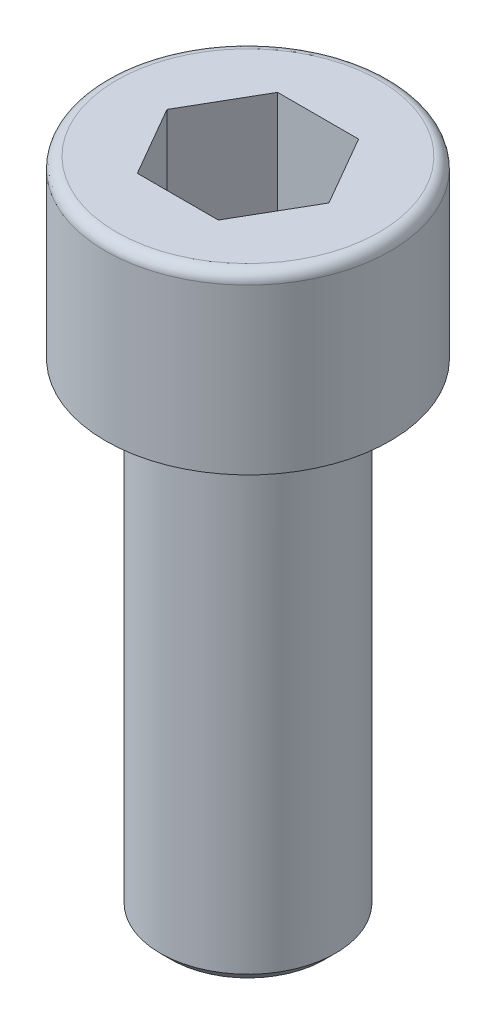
ISO-10303-21;
HEADER;
FILE_DESCRIPTION(('STEP AP214'),'2;1');
FILE_NAME('part.step','',(''),(''),'','','');
FILE_SCHEMA(('AUTOMOTIVE_DESIGN { 1 0 10303 214 1 1 1 1 }'));
ENDSEC;
DATA;
#1=APPLICATION_CONTEXT('core data for automotive mechanical design processes');
#2=APPLICATION_PROTOCOL_DEFINITION('international standard','automotive_design',2000,#1);
#3=PRODUCT_CONTEXT('',#1,'mechanical');
#4=PRODUCT('Part','Part','',(#3));
#5=PRODUCT_RELATED_PRODUCT_CATEGORY('part','',(#4));
#6=PRODUCT_DEFINITION_FORMATION('','',#4);
#7=PRODUCT_DEFINITION_CONTEXT('part definition',#1,'design');
#8=PRODUCT_DEFINITION('design','',#6,#7);
#9=PRODUCT_DEFINITION_SHAPE('','',#8);
#10=(LENGTH_UNIT() NAMED_UNIT(*) SI_UNIT(.MILLI.,.METRE.));
#11=(NAMED_UNIT(*) PLANE_ANGLE_UNIT() SI_UNIT($,.RADIAN.));
#12=(NAMED_UNIT(*) SI_UNIT($,.STERADIAN.) SOLID_ANGLE_UNIT());
#13=UNCERTAINTY_MEASURE_WITH_UNIT(LENGTH_MEASURE(1.E-05),#10,'distance_accuracy_value','');
#14=(GEOMETRIC_REPRESENTATION_CONTEXT(3) GLOBAL_UNCERTAINTY_ASSIGNED_CONTEXT((#13)) GLOBAL_UNIT_ASSIGNED_CONTEXT((#10,
#11,#12)) REPRESENTATION_CONTEXT('',''));
#15=CARTESIAN_POINT('',(0.,0.,0.));
#16=DIRECTION('',(0.,0.,1.));
#17=DIRECTION('',(1.,0.,0.));
#18=AXIS2_PLACEMENT_3D('',#15,#16,#17);
#19=CARTESIAN_POINT('',(0.,-26.,0.));
#20=DIRECTION('',(0.,1.,0.));
#21=DIRECTION('',(0.,0.,1.));
#22=AXIS2_PLACEMENT_3D('',#19,#20,#21);
#23=CYLINDRICAL_SURFACE('',#22,4.);
#24=CARTESIAN_POINT('',(0.,-4.,0.));
#25=DIRECTION('',(0.,1.,0.));
#26=DIRECTION('',(0.,0.,1.));
#27=AXIS2_PLACEMENT_3D('',#24,#25,#26);
#28=CIRCLE('',#27,4.);
#29=CARTESIAN_POINT('',(0.,-4.,4.));
#30=VERTEX_POINT('',#29);
#31=EDGE_CURVE('E165',#30,#30,#28,.F.);
#32=ORIENTED_EDGE('',*,*,#31,.T.);
#33=EDGE_LOOP('',(#32));
#34=FACE_BOUND('',#33,.T.);
#35=CARTESIAN_POINT('',(0.,-25.5,0.));
#36=DIRECTION('',(0.,1.,0.));
#37=DIRECTION('',(0.,0.,1.));
#38=AXIS2_PLACEMENT_3D('',#35,#36,#37);
#39=CIRCLE('',#38,4.);
#40=CARTESIAN_POINT('',(0.,-25.5,4.));
#41=VERTEX_POINT('',#40);
#42=EDGE_CURVE('E159',#41,#41,#39,.F.);
#43=ORIENTED_EDGE('',*,*,#42,.F.);
#44=EDGE_LOOP('',(#43));
#45=FACE_BOUND('',#44,.T.);
#46=ADVANCED_FACE('F49',(#34,#45),#23,.T.);
#47=CARTESIAN_POINT('',(0.,4.,0.));
#48=DIRECTION('',(0.,-1.,0.));
#49=DIRECTION('',(0.,0.,-1.));
#50=AXIS2_PLACEMENT_3D('',#47,#48,#49);
#51=CYLINDRICAL_SURFACE('',#50,6.5);
#52=CARTESIAN_POINT('',(0.,3.5,0.));
#53=DIRECTION('',(0.,1.,0.));
#54=DIRECTION('',(0.,0.,1.));
#55=AXIS2_PLACEMENT_3D('',#52,#53,#54);
#56=CIRCLE('',#55,6.5);
#57=CARTESIAN_POINT('',(0.,3.5,6.5));
#58=VERTEX_POINT('',#57);
#59=EDGE_CURVE('E14',#58,#58,#56,.F.);
#60=ORIENTED_EDGE('',*,*,#59,.T.);
#61=EDGE_LOOP('',(#60));
#62=FACE_BOUND('',#61,.T.);
#63=CARTESIAN_POINT('',(0.,-4.,0.));
#64=DIRECTION('',(0.,1.,0.));
#65=DIRECTION('',(0.,0.,1.));
#66=AXIS2_PLACEMENT_3D('',#63,#64,#65);
#67=CIRCLE('',#66,6.5);
#68=CARTESIAN_POINT('',(0.,-4.,6.5));
#69=VERTEX_POINT('',#68);
#70=EDGE_CURVE('E162',#69,#69,#67,.T.);
#71=ORIENTED_EDGE('',*,*,#70,.T.);
#72=EDGE_LOOP('',(#71));
#73=FACE_BOUND('',#72,.T.);
#74=ADVANCED_FACE('F182',(#62,#73),#51,.T.);
#75=CARTESIAN_POINT('',(0.,4.,0.));
#76=DIRECTION('',(0.,1.,0.));
#77=DIRECTION('',(0.,0.,1.));
#78=AXIS2_PLACEMENT_3D('',#75,#76,#77);
#79=PLANE('',#78);
#80=CARTESIAN_POINT('',(0.,4.,0.));
#81=DIRECTION('',(0.,1.,0.));
#82=DIRECTION('',(0.,0.,1.));
#83=AXIS2_PLACEMENT_3D('',#80,#81,#82);
#84=CIRCLE('',#83,6.);
#85=CARTESIAN_POINT('',(0.,4.,6.));
#86=VERTEX_POINT('',#85);
#87=EDGE_CURVE('E57',#86,#86,#84,.T.);
#88=ORIENTED_EDGE('',*,*,#87,.T.);
#89=EDGE_LOOP('',(#88));
#90=FACE_BOUND('',#89,.T.);
#91=DIRECTION('',(-0.5,0.,-0.866025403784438));
#92=VECTOR('',#91,1.);
#93=CARTESIAN_POINT('',(3.6950417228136,4.,0.));
#94=LINE('',#93,#92);
#95=CARTESIAN_POINT('',(3.6950417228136,4.,0.));
#96=VERTEX_POINT('',#95);
#97=CARTESIAN_POINT('',(1.8475208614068,4.,-3.2));
#98=VERTEX_POINT('',#97);
#99=EDGE_CURVE('E64',#96,#98,#94,.T.);
#100=ORIENTED_EDGE('',*,*,#99,.F.);
#101=DIRECTION('',(0.5,0.,-0.866025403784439));
#102=VECTOR('',#101,1.);
#103=CARTESIAN_POINT('',(1.8475208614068,4.,3.2));
#104=LINE('',#103,#102);
#105=CARTESIAN_POINT('',(1.8475208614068,4.,3.2));
#106=VERTEX_POINT('',#105);
#107=EDGE_CURVE('E147',#106,#96,#104,.T.);
#108=ORIENTED_EDGE('',*,*,#107,.F.);
#109=DIRECTION('',(1.,0.,0.));
#110=VECTOR('',#109,1.);
#111=CARTESIAN_POINT('',(-1.8475208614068,4.,3.2));
#112=LINE('',#111,#110);
#113=CARTESIAN_POINT('',(-1.8475208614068,4.,3.2));
#114=VERTEX_POINT('',#113);
#115=EDGE_CURVE('E145',#114,#106,#112,.T.);
#116=ORIENTED_EDGE('',*,*,#115,.F.);
#117=DIRECTION('',(0.5,0.,0.866025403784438));
#118=VECTOR('',#117,1.);
#119=CARTESIAN_POINT('',(-3.6950417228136,4.,0.));
#120=LINE('',#119,#118);
#121=CARTESIAN_POINT('',(-3.6950417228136,4.,0.));
#122=VERTEX_POINT('',#121);
#123=EDGE_CURVE('E112',#122,#114,#120,.T.);
#124=ORIENTED_EDGE('',*,*,#123,.F.);
#125=DIRECTION('',(-0.5,0.,0.866025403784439));
#126=VECTOR('',#125,1.);
#127=CARTESIAN_POINT('',(-1.8475208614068,4.,-3.2));
#128=LINE('',#127,#126);
#129=CARTESIAN_POINT('',(-1.8475208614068,4.,-3.2));
#130=VERTEX_POINT('',#129);
#131=EDGE_CURVE('E141',#130,#122,#128,.T.);
#132=ORIENTED_EDGE('',*,*,#131,.F.);
#133=DIRECTION('',(-1.,0.,0.));
#134=VECTOR('',#133,1.);
#135=CARTESIAN_POINT('',(1.8475208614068,4.,-3.2));
#136=LINE('',#135,#134);
#137=EDGE_CURVE('E138',#98,#130,#136,.T.);
#138=ORIENTED_EDGE('',*,*,#137,.F.);
#139=EDGE_LOOP('',(#100,#108,#116,#124,#132,#138));
#140=FACE_BOUND('',#139,.T.);
#141=ADVANCED_FACE('F170',(#90,#140),#79,.T.);
#142=CARTESIAN_POINT('',(0.,-4.,0.));
#143=DIRECTION('',(0.,1.,0.));
#144=DIRECTION('',(0.,0.,1.));
#145=AXIS2_PLACEMENT_3D('',#142,#143,#144);
#146=PLANE('',#145);
#147=ORIENTED_EDGE('',*,*,#31,.F.);
#148=EDGE_LOOP('',(#147));
#149=FACE_BOUND('',#148,.T.);
#150=ORIENTED_EDGE('',*,*,#70,.F.);
#151=EDGE_LOOP('',(#150));
#152=FACE_BOUND('',#151,.T.);
#153=ADVANCED_FACE('F196',(#149,#152),#146,.F.);
#154=CARTESIAN_POINT('',(0.,-26.,0.));
#155=DIRECTION('',(0.,1.,0.));
#156=DIRECTION('',(0.,0.,-1.));
#157=AXIS2_PLACEMENT_3D('',#154,#155,#156);
#158=CONICAL_SURFACE('',#157,3.5,0.78539816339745);
#159=CARTESIAN_POINT('',(0.,-26.,0.));
#160=DIRECTION('',(0.,-1.,0.));
#161=DIRECTION('',(0.,0.,-1.));
#162=AXIS2_PLACEMENT_3D('',#159,#160,#161);
#163=CIRCLE('',#162,3.5);
#164=CARTESIAN_POINT('',(0.,-26.,-3.5));
#165=VERTEX_POINT('',#164);
#166=EDGE_CURVE('E151',#165,#165,#163,.T.);
#167=ORIENTED_EDGE('',*,*,#166,.F.);
#168=EDGE_LOOP('',(#167));
#169=FACE_BOUND('',#168,.T.);
#170=ORIENTED_EDGE('',*,*,#42,.T.);
#171=EDGE_LOOP('',(#170));
#172=FACE_BOUND('',#171,.T.);
#173=ADVANCED_FACE('F198',(#169,#172),#158,.T.);
#174=CARTESIAN_POINT('',(0.,-26.,0.));
#175=DIRECTION('',(0.,-1.,0.));
#176=DIRECTION('',(0.,0.,-1.));
#177=AXIS2_PLACEMENT_3D('',#174,#175,#176);
#178=PLANE('',#177);
#179=ORIENTED_EDGE('',*,*,#166,.T.);
#180=EDGE_LOOP('',(#179));
#181=FACE_BOUND('',#180,.T.);
#182=ADVANCED_FACE('F192',(#181),#178,.T.);
#183=CARTESIAN_POINT('',(3.6950417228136,-1.,0.));
#184=DIRECTION('',(0.866025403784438,0.,-0.5));
#185=DIRECTION('',(-0.5,0.,-0.866025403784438));
#186=AXIS2_PLACEMENT_3D('',#183,#184,#185);
#187=PLANE('',#186);
#188=ORIENTED_EDGE('',*,*,#99,.T.);
#189=DIRECTION('',(0.,1.,0.));
#190=VECTOR('',#189,1.);
#191=CARTESIAN_POINT('',(1.8475208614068,-1.,-3.2));
#192=LINE('',#191,#190);
#193=CARTESIAN_POINT('',(1.8475208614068,-1.,-3.2));
#194=VERTEX_POINT('',#193);
#195=EDGE_CURVE('E94',#194,#98,#192,.T.);
#196=ORIENTED_EDGE('',*,*,#195,.F.);
#197=DIRECTION('',(-0.5,0.,-0.866025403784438));
#198=VECTOR('',#197,1.);
#199=CARTESIAN_POINT('',(3.6950417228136,-1.,0.));
#200=LINE('',#199,#198);
#201=CARTESIAN_POINT('',(3.6950417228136,-1.,0.));
#202=VERTEX_POINT('',#201);
#203=EDGE_CURVE('E149',#202,#194,#200,.T.);
#204=ORIENTED_EDGE('',*,*,#203,.F.);
#205=DIRECTION('',(0.,1.,0.));
#206=VECTOR('',#205,1.);
#207=CARTESIAN_POINT('',(3.6950417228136,-1.,0.));
#208=LINE('',#207,#206);
#209=EDGE_CURVE('E72',#202,#96,#208,.T.);
#210=ORIENTED_EDGE('',*,*,#209,.T.);
#211=EDGE_LOOP('',(#188,#196,#204,#210));
#212=FACE_BOUND('',#211,.T.);
#213=ADVANCED_FACE('F211',(#212),#187,.F.);
#214=CARTESIAN_POINT('',(1.8475208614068,-1.,3.2));
#215=DIRECTION('',(0.866025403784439,0.,0.5));
#216=DIRECTION('',(0.5,0.,-0.866025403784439));
#217=AXIS2_PLACEMENT_3D('',#214,#215,#216);
#218=PLANE('',#217);
#219=ORIENTED_EDGE('',*,*,#107,.T.);
#220=ORIENTED_EDGE('',*,*,#209,.F.);
#221=DIRECTION('',(0.5,0.,-0.866025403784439));
#222=VECTOR('',#221,1.);
#223=CARTESIAN_POINT('',(1.8475208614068,-1.,3.2));
#224=LINE('',#223,#222);
#225=CARTESIAN_POINT('',(1.8475208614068,-1.,3.2));
#226=VERTEX_POINT('',#225);
#227=EDGE_CURVE('E124',#226,#202,#224,.T.);
#228=ORIENTED_EDGE('',*,*,#227,.F.);
#229=DIRECTION('',(0.,1.,0.));
#230=VECTOR('',#229,1.);
#231=CARTESIAN_POINT('',(1.8475208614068,-1.,3.2));
#232=LINE('',#231,#230);
#233=EDGE_CURVE('E116',#226,#106,#232,.T.);
#234=ORIENTED_EDGE('',*,*,#233,.T.);
#235=EDGE_LOOP('',(#219,#220,#228,#234));
#236=FACE_BOUND('',#235,.T.);
#237=ADVANCED_FACE('F218',(#236),#218,.F.);
#238=CARTESIAN_POINT('',(-1.8475208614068,-1.,3.2));
#239=DIRECTION('',(0.,0.,1.));
#240=DIRECTION('',(1.,0.,0.));
#241=AXIS2_PLACEMENT_3D('',#238,#239,#240);
#242=PLANE('',#241);
#243=ORIENTED_EDGE('',*,*,#115,.T.);
#244=ORIENTED_EDGE('',*,*,#233,.F.);
#245=DIRECTION('',(1.,0.,0.));
#246=VECTOR('',#245,1.);
#247=CARTESIAN_POINT('',(-1.8475208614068,-1.,3.2));
#248=LINE('',#247,#246);
#249=CARTESIAN_POINT('',(-1.8475208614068,-1.,3.2));
#250=VERTEX_POINT('',#249);
#251=EDGE_CURVE('E120',#250,#226,#248,.T.);
#252=ORIENTED_EDGE('',*,*,#251,.F.);
#253=DIRECTION('',(0.,1.,0.));
#254=VECTOR('',#253,1.);
#255=CARTESIAN_POINT('',(-1.8475208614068,-1.,3.2));
#256=LINE('',#255,#254);
#257=EDGE_CURVE('E105',#250,#114,#256,.T.);
#258=ORIENTED_EDGE('',*,*,#257,.T.);
#259=EDGE_LOOP('',(#243,#244,#252,#258));
#260=FACE_BOUND('',#259,.T.);
#261=ADVANCED_FACE('F121',(#260),#242,.F.);
#262=CARTESIAN_POINT('',(-3.6950417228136,-1.,0.));
#263=DIRECTION('',(-0.866025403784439,0.,0.5));
#264=DIRECTION('',(0.5,0.,0.866025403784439));
#265=AXIS2_PLACEMENT_3D('',#262,#263,#264);
#266=PLANE('',#265);
#267=ORIENTED_EDGE('',*,*,#123,.T.);
#268=ORIENTED_EDGE('',*,*,#257,.F.);
#269=DIRECTION('',(0.5,0.,0.866025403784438));
#270=VECTOR('',#269,1.);
#271=CARTESIAN_POINT('',(-3.6950417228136,-1.,0.));
#272=LINE('',#271,#270);
#273=CARTESIAN_POINT('',(-3.6950417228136,-1.,0.));
#274=VERTEX_POINT('',#273);
#275=EDGE_CURVE('E109',#274,#250,#272,.T.);
#276=ORIENTED_EDGE('',*,*,#275,.F.);
#277=DIRECTION('',(0.,1.,0.));
#278=VECTOR('',#277,1.);
#279=CARTESIAN_POINT('',(-3.6950417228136,-1.,0.));
#280=LINE('',#279,#278);
#281=EDGE_CURVE('E117',#274,#122,#280,.T.);
#282=ORIENTED_EDGE('',*,*,#281,.T.);
#283=EDGE_LOOP('',(#267,#268,#276,#282));
#284=FACE_BOUND('',#283,.T.);
#285=ADVANCED_FACE('F107',(#284),#266,.F.);
#286=CARTESIAN_POINT('',(-1.8475208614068,-1.,-3.2));
#287=DIRECTION('',(-0.866025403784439,0.,-0.5));
#288=DIRECTION('',(-0.5,0.,0.866025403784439));
#289=AXIS2_PLACEMENT_3D('',#286,#287,#288);
#290=PLANE('',#289);
#291=ORIENTED_EDGE('',*,*,#131,.T.);
#292=ORIENTED_EDGE('',*,*,#281,.F.);
#293=DIRECTION('',(-0.5,0.,0.866025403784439));
#294=VECTOR('',#293,1.);
#295=CARTESIAN_POINT('',(-1.8475208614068,-1.,-3.2));
#296=LINE('',#295,#294);
#297=CARTESIAN_POINT('',(-1.8475208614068,-1.,-3.2));
#298=VERTEX_POINT('',#297);
#299=EDGE_CURVE('E130',#298,#274,#296,.T.);
#300=ORIENTED_EDGE('',*,*,#299,.F.);
#301=DIRECTION('',(0.,1.,0.));
#302=VECTOR('',#301,1.);
#303=CARTESIAN_POINT('',(-1.8475208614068,-1.,-3.2));
#304=LINE('',#303,#302);
#305=EDGE_CURVE('E154',#298,#130,#304,.T.);
#306=ORIENTED_EDGE('',*,*,#305,.T.);
#307=EDGE_LOOP('',(#291,#292,#300,#306));
#308=FACE_BOUND('',#307,.T.);
#309=ADVANCED_FACE('F221',(#308),#290,.F.);
#310=CARTESIAN_POINT('',(1.8475208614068,-1.,-3.2));
#311=DIRECTION('',(0.,0.,-1.));
#312=DIRECTION('',(-1.,0.,0.));
#313=AXIS2_PLACEMENT_3D('',#310,#311,#312);
#314=PLANE('',#313);
#315=ORIENTED_EDGE('',*,*,#137,.T.);
#316=ORIENTED_EDGE('',*,*,#305,.F.);
#317=DIRECTION('',(-1.,0.,0.));
#318=VECTOR('',#317,1.);
#319=CARTESIAN_POINT('',(1.8475208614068,-1.,-3.2));
#320=LINE('',#319,#318);
#321=EDGE_CURVE('E132',#194,#298,#320,.T.);
#322=ORIENTED_EDGE('',*,*,#321,.F.);
#323=ORIENTED_EDGE('',*,*,#195,.T.);
#324=EDGE_LOOP('',(#315,#316,#322,#323));
#325=FACE_BOUND('',#324,.T.);
#326=ADVANCED_FACE('F178',(#325),#314,.F.);
#327=CARTESIAN_POINT('',(0.,-1.,0.));
#328=DIRECTION('',(0.,1.,0.));
#329=DIRECTION('',(0.,0.,1.));
#330=AXIS2_PLACEMENT_3D('',#327,#328,#329);
#331=PLANE('',#330);
#332=ORIENTED_EDGE('',*,*,#203,.T.);
#333=ORIENTED_EDGE('',*,*,#321,.T.);
#334=ORIENTED_EDGE('',*,*,#299,.T.);
#335=ORIENTED_EDGE('',*,*,#275,.T.);
#336=ORIENTED_EDGE('',*,*,#251,.T.);
#337=ORIENTED_EDGE('',*,*,#227,.T.);
#338=EDGE_LOOP('',(#332,#333,#334,#335,#336,#337));
#339=FACE_BOUND('',#338,.T.);
#340=ADVANCED_FACE('F127',(#339),#331,.T.);
#341=CARTESIAN_POINT('',(0.,3.5,0.));
#342=DIRECTION('',(0.,1.,0.));
#343=DIRECTION('',(0.,0.,1.));
#344=AXIS2_PLACEMENT_3D('',#341,#342,#343);
#345=TOROIDAL_SURFACE('',#344,6.,0.5);
#346=ORIENTED_EDGE('',*,*,#59,.F.);
#347=EDGE_LOOP('',(#346));
#348=FACE_BOUND('',#347,.T.);
#349=ORIENTED_EDGE('',*,*,#87,.F.);
#350=EDGE_LOOP('',(#349));
#351=FACE_BOUND('',#350,.T.);
#352=ADVANCED_FACE('F51',(#348,#351),#345,.T.);
#353=CLOSED_SHELL('',(#46,#74,#141,#153,#173,#182,#213,#237,#261,#285,#309,#326,#340,#352));
#354=MANIFOLD_SOLID_BREP('B2',#353);
#355=ADVANCED_BREP_SHAPE_REPRESENTATION('',(#18,#354),#14);
#356=SHAPE_DEFINITION_REPRESENTATION(#9,#355);
ENDSEC;
END-ISO-10303-21;
